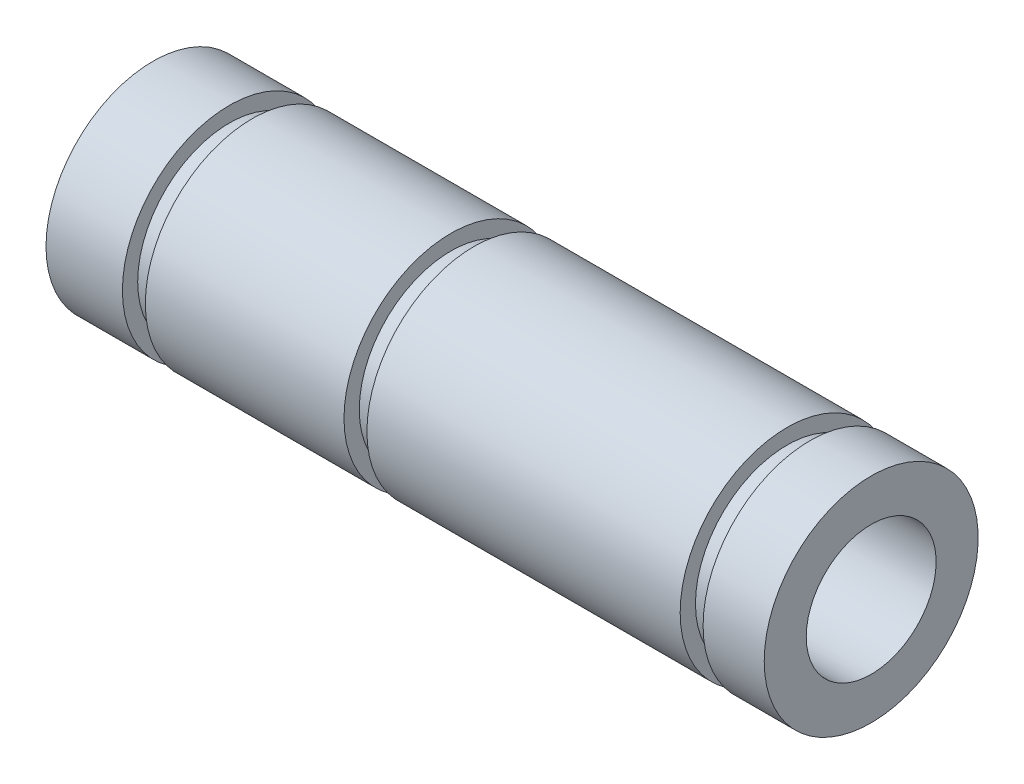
ISO-10303-21;
HEADER;
FILE_DESCRIPTION(('STEP AP214'),'2;1');
FILE_NAME('part.step','',(''),(''),'','','');
FILE_SCHEMA(('AUTOMOTIVE_DESIGN { 1 0 10303 214 1 1 1 1 }'));
ENDSEC;
DATA;
#1=APPLICATION_CONTEXT('core data for automotive mechanical design processes');
#2=APPLICATION_PROTOCOL_DEFINITION('international standard','automotive_design',2000,#1);
#3=PRODUCT_CONTEXT('',#1,'mechanical');
#4=PRODUCT('Part','Part','',(#3));
#5=PRODUCT_RELATED_PRODUCT_CATEGORY('part','',(#4));
#6=PRODUCT_DEFINITION_FORMATION('','',#4);
#7=PRODUCT_DEFINITION_CONTEXT('part definition',#1,'design');
#8=PRODUCT_DEFINITION('design','',#6,#7);
#9=PRODUCT_DEFINITION_SHAPE('','',#8);
#10=(LENGTH_UNIT() NAMED_UNIT(*) SI_UNIT(.MILLI.,.METRE.));
#11=(NAMED_UNIT(*) PLANE_ANGLE_UNIT() SI_UNIT($,.RADIAN.));
#12=(NAMED_UNIT(*) SI_UNIT($,.STERADIAN.) SOLID_ANGLE_UNIT());
#13=UNCERTAINTY_MEASURE_WITH_UNIT(LENGTH_MEASURE(1.E-05),#10,'distance_accuracy_value','');
#14=(GEOMETRIC_REPRESENTATION_CONTEXT(3) GLOBAL_UNCERTAINTY_ASSIGNED_CONTEXT((#13)) GLOBAL_UNIT_ASSIGNED_CONTEXT((#10,
#11,#12)) REPRESENTATION_CONTEXT('',''));
#15=CARTESIAN_POINT('',(0.,0.,0.));
#16=DIRECTION('',(0.,0.,1.));
#17=DIRECTION('',(1.,0.,0.));
#18=AXIS2_PLACEMENT_3D('',#15,#16,#17);
#19=CARTESIAN_POINT('',(0.,4.25,0.));
#20=DIRECTION('',(1.,0.,0.));
#21=DIRECTION('',(0.,0.,-1.));
#22=AXIS2_PLACEMENT_3D('',#19,#20,#21);
#23=PLANE('',#22);
#24=CARTESIAN_POINT('',(0.,0.,0.));
#25=DIRECTION('',(-1.,0.,0.));
#26=DIRECTION('',(0.,0.,1.));
#27=AXIS2_PLACEMENT_3D('',#24,#25,#26);
#28=CIRCLE('',#27,4.25);
#29=CARTESIAN_POINT('',(0.,0.,4.25));
#30=VERTEX_POINT('',#29);
#31=EDGE_CURVE('E84',#30,#30,#28,.T.);
#32=ORIENTED_EDGE('',*,*,#31,.F.);
#33=EDGE_LOOP('',(#32));
#34=FACE_BOUND('',#33,.T.);
#35=CARTESIAN_POINT('',(0.,0.,0.));
#36=DIRECTION('',(-1.,0.,0.));
#37=DIRECTION('',(0.,0.,1.));
#38=AXIS2_PLACEMENT_3D('',#35,#36,#37);
#39=CIRCLE('',#38,7.);
#40=CARTESIAN_POINT('',(0.,0.,7.));
#41=VERTEX_POINT('',#40);
#42=EDGE_CURVE('E10',#41,#41,#39,.T.);
#43=ORIENTED_EDGE('',*,*,#42,.T.);
#44=EDGE_LOOP('',(#43));
#45=FACE_BOUND('',#44,.T.);
#46=ADVANCED_FACE('F32',(#34,#45),#23,.F.);
#47=CARTESIAN_POINT('',(0.,0.,0.));
#48=DIRECTION('',(-1.,0.,0.));
#49=DIRECTION('',(0.,0.,1.));
#50=AXIS2_PLACEMENT_3D('',#47,#48,#49);
#51=CYLINDRICAL_SURFACE('',#50,7.);
#52=ORIENTED_EDGE('',*,*,#42,.F.);
#53=EDGE_LOOP('',(#52));
#54=FACE_BOUND('',#53,.T.);
#55=CARTESIAN_POINT('',(4.99999999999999,0.,0.));
#56=DIRECTION('',(-1.,0.,0.));
#57=DIRECTION('',(0.,0.,1.));
#58=AXIS2_PLACEMENT_3D('',#55,#56,#57);
#59=CIRCLE('',#58,7.);
#60=CARTESIAN_POINT('',(4.99999999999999,0.,7.));
#61=VERTEX_POINT('',#60);
#62=EDGE_CURVE('E38',#61,#61,#59,.T.);
#63=ORIENTED_EDGE('',*,*,#62,.T.);
#64=EDGE_LOOP('',(#63));
#65=FACE_BOUND('',#64,.T.);
#66=ADVANCED_FACE('F91',(#54,#65),#51,.T.);
#67=CARTESIAN_POINT('',(4.99999999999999,7.,0.));
#68=DIRECTION('',(-1.,0.,0.));
#69=DIRECTION('',(0.,0.,1.));
#70=AXIS2_PLACEMENT_3D('',#67,#68,#69);
#71=PLANE('',#70);
#72=ORIENTED_EDGE('',*,*,#62,.F.);
#73=EDGE_LOOP('',(#72));
#74=FACE_BOUND('',#73,.T.);
#75=CARTESIAN_POINT('',(4.99999999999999,0.,0.));
#76=DIRECTION('',(-1.,0.,0.));
#77=DIRECTION('',(0.,0.,1.));
#78=AXIS2_PLACEMENT_3D('',#75,#76,#77);
#79=CIRCLE('',#78,6.);
#80=CARTESIAN_POINT('',(4.99999999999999,0.,6.));
#81=VERTEX_POINT('',#80);
#82=EDGE_CURVE('E42',#81,#81,#79,.T.);
#83=ORIENTED_EDGE('',*,*,#82,.T.);
#84=EDGE_LOOP('',(#83));
#85=FACE_BOUND('',#84,.T.);
#86=ADVANCED_FACE('F95',(#74,#85),#71,.F.);
#87=CARTESIAN_POINT('',(0.,0.,0.));
#88=DIRECTION('',(-1.,0.,0.));
#89=DIRECTION('',(0.,0.,1.));
#90=AXIS2_PLACEMENT_3D('',#87,#88,#89);
#91=CYLINDRICAL_SURFACE('',#90,6.);
#92=ORIENTED_EDGE('',*,*,#82,.F.);
#93=EDGE_LOOP('',(#92));
#94=FACE_BOUND('',#93,.T.);
#95=CARTESIAN_POINT('',(6.49999999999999,0.,0.));
#96=DIRECTION('',(-1.,0.,0.));
#97=DIRECTION('',(0.,0.,1.));
#98=AXIS2_PLACEMENT_3D('',#95,#96,#97);
#99=CIRCLE('',#98,6.);
#100=CARTESIAN_POINT('',(6.49999999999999,0.,6.));
#101=VERTEX_POINT('',#100);
#102=EDGE_CURVE('E46',#101,#101,#99,.T.);
#103=ORIENTED_EDGE('',*,*,#102,.T.);
#104=EDGE_LOOP('',(#103));
#105=FACE_BOUND('',#104,.T.);
#106=ADVANCED_FACE('F100',(#94,#105),#91,.T.);
#107=CARTESIAN_POINT('',(6.49999999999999,7.,0.));
#108=DIRECTION('',(1.,0.,0.));
#109=DIRECTION('',(0.,0.,-1.));
#110=AXIS2_PLACEMENT_3D('',#107,#108,#109);
#111=PLANE('',#110);
#112=ORIENTED_EDGE('',*,*,#102,.F.);
#113=EDGE_LOOP('',(#112));
#114=FACE_BOUND('',#113,.T.);
#115=CARTESIAN_POINT('',(6.49999999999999,0.,0.));
#116=DIRECTION('',(-1.,0.,0.));
#117=DIRECTION('',(0.,0.,1.));
#118=AXIS2_PLACEMENT_3D('',#115,#116,#117);
#119=CIRCLE('',#118,7.);
#120=CARTESIAN_POINT('',(6.49999999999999,0.,7.));
#121=VERTEX_POINT('',#120);
#122=EDGE_CURVE('E51',#121,#121,#119,.T.);
#123=ORIENTED_EDGE('',*,*,#122,.T.);
#124=EDGE_LOOP('',(#123));
#125=FACE_BOUND('',#124,.T.);
#126=ADVANCED_FACE('F106',(#114,#125),#111,.F.);
#127=CARTESIAN_POINT('',(0.,0.,0.));
#128=DIRECTION('',(-1.,0.,0.));
#129=DIRECTION('',(0.,0.,1.));
#130=AXIS2_PLACEMENT_3D('',#127,#128,#129);
#131=CYLINDRICAL_SURFACE('',#130,7.);
#132=ORIENTED_EDGE('',*,*,#122,.F.);
#133=EDGE_LOOP('',(#132));
#134=FACE_BOUND('',#133,.T.);
#135=CARTESIAN_POINT('',(19.5,0.,0.));
#136=DIRECTION('',(-1.,0.,0.));
#137=DIRECTION('',(0.,0.,1.));
#138=AXIS2_PLACEMENT_3D('',#135,#136,#137);
#139=CIRCLE('',#138,7.);
#140=CARTESIAN_POINT('',(19.5,0.,7.));
#141=VERTEX_POINT('',#140);
#142=EDGE_CURVE('E54',#141,#141,#139,.T.);
#143=ORIENTED_EDGE('',*,*,#142,.T.);
#144=EDGE_LOOP('',(#143));
#145=FACE_BOUND('',#144,.T.);
#146=ADVANCED_FACE('F110',(#134,#145),#131,.T.);
#147=CARTESIAN_POINT('',(19.5,7.,0.));
#148=DIRECTION('',(-1.,0.,0.));
#149=DIRECTION('',(0.,0.,1.));
#150=AXIS2_PLACEMENT_3D('',#147,#148,#149);
#151=PLANE('',#150);
#152=ORIENTED_EDGE('',*,*,#142,.F.);
#153=EDGE_LOOP('',(#152));
#154=FACE_BOUND('',#153,.T.);
#155=CARTESIAN_POINT('',(19.5,0.,0.));
#156=DIRECTION('',(-1.,0.,0.));
#157=DIRECTION('',(0.,0.,1.));
#158=AXIS2_PLACEMENT_3D('',#155,#156,#157);
#159=CIRCLE('',#158,6.);
#160=CARTESIAN_POINT('',(19.5,0.,6.));
#161=VERTEX_POINT('',#160);
#162=EDGE_CURVE('E57',#161,#161,#159,.T.);
#163=ORIENTED_EDGE('',*,*,#162,.T.);
#164=EDGE_LOOP('',(#163));
#165=FACE_BOUND('',#164,.T.);
#166=ADVANCED_FACE('F114',(#154,#165),#151,.F.);
#167=CARTESIAN_POINT('',(0.,0.,0.));
#168=DIRECTION('',(-1.,0.,0.));
#169=DIRECTION('',(0.,0.,1.));
#170=AXIS2_PLACEMENT_3D('',#167,#168,#169);
#171=CYLINDRICAL_SURFACE('',#170,6.);
#172=ORIENTED_EDGE('',*,*,#162,.F.);
#173=EDGE_LOOP('',(#172));
#174=FACE_BOUND('',#173,.T.);
#175=CARTESIAN_POINT('',(21.,0.,0.));
#176=DIRECTION('',(-1.,0.,0.));
#177=DIRECTION('',(0.,0.,1.));
#178=AXIS2_PLACEMENT_3D('',#175,#176,#177);
#179=CIRCLE('',#178,6.);
#180=CARTESIAN_POINT('',(21.,0.,6.));
#181=VERTEX_POINT('',#180);
#182=EDGE_CURVE('E60',#181,#181,#179,.T.);
#183=ORIENTED_EDGE('',*,*,#182,.T.);
#184=EDGE_LOOP('',(#183));
#185=FACE_BOUND('',#184,.T.);
#186=ADVANCED_FACE('F118',(#174,#185),#171,.T.);
#187=CARTESIAN_POINT('',(21.,7.,0.));
#188=DIRECTION('',(1.,0.,0.));
#189=DIRECTION('',(0.,0.,-1.));
#190=AXIS2_PLACEMENT_3D('',#187,#188,#189);
#191=PLANE('',#190);
#192=ORIENTED_EDGE('',*,*,#182,.F.);
#193=EDGE_LOOP('',(#192));
#194=FACE_BOUND('',#193,.T.);
#195=CARTESIAN_POINT('',(21.,0.,0.));
#196=DIRECTION('',(-1.,0.,0.));
#197=DIRECTION('',(0.,0.,1.));
#198=AXIS2_PLACEMENT_3D('',#195,#196,#197);
#199=CIRCLE('',#198,7.);
#200=CARTESIAN_POINT('',(21.,0.,7.));
#201=VERTEX_POINT('',#200);
#202=EDGE_CURVE('E63',#201,#201,#199,.T.);
#203=ORIENTED_EDGE('',*,*,#202,.T.);
#204=EDGE_LOOP('',(#203));
#205=FACE_BOUND('',#204,.T.);
#206=ADVANCED_FACE('F122',(#194,#205),#191,.F.);
#207=CARTESIAN_POINT('',(0.,0.,0.));
#208=DIRECTION('',(-1.,0.,0.));
#209=DIRECTION('',(0.,0.,1.));
#210=AXIS2_PLACEMENT_3D('',#207,#208,#209);
#211=CYLINDRICAL_SURFACE('',#210,7.);
#212=ORIENTED_EDGE('',*,*,#202,.F.);
#213=EDGE_LOOP('',(#212));
#214=FACE_BOUND('',#213,.T.);
#215=CARTESIAN_POINT('',(41.5,0.,0.));
#216=DIRECTION('',(-1.,0.,0.));
#217=DIRECTION('',(0.,0.,1.));
#218=AXIS2_PLACEMENT_3D('',#215,#216,#217);
#219=CIRCLE('',#218,7.);
#220=CARTESIAN_POINT('',(41.5,0.,7.));
#221=VERTEX_POINT('',#220);
#222=EDGE_CURVE('E66',#221,#221,#219,.T.);
#223=ORIENTED_EDGE('',*,*,#222,.T.);
#224=EDGE_LOOP('',(#223));
#225=FACE_BOUND('',#224,.T.);
#226=ADVANCED_FACE('F126',(#214,#225),#211,.T.);
#227=CARTESIAN_POINT('',(41.5,7.,0.));
#228=DIRECTION('',(-1.,0.,0.));
#229=DIRECTION('',(0.,0.,1.));
#230=AXIS2_PLACEMENT_3D('',#227,#228,#229);
#231=PLANE('',#230);
#232=ORIENTED_EDGE('',*,*,#222,.F.);
#233=EDGE_LOOP('',(#232));
#234=FACE_BOUND('',#233,.T.);
#235=CARTESIAN_POINT('',(41.5,0.,0.));
#236=DIRECTION('',(-1.,0.,0.));
#237=DIRECTION('',(0.,0.,1.));
#238=AXIS2_PLACEMENT_3D('',#235,#236,#237);
#239=CIRCLE('',#238,6.);
#240=CARTESIAN_POINT('',(41.5,0.,6.));
#241=VERTEX_POINT('',#240);
#242=EDGE_CURVE('E69',#241,#241,#239,.T.);
#243=ORIENTED_EDGE('',*,*,#242,.T.);
#244=EDGE_LOOP('',(#243));
#245=FACE_BOUND('',#244,.T.);
#246=ADVANCED_FACE('F130',(#234,#245),#231,.F.);
#247=CARTESIAN_POINT('',(0.,0.,0.));
#248=DIRECTION('',(-1.,0.,0.));
#249=DIRECTION('',(0.,0.,1.));
#250=AXIS2_PLACEMENT_3D('',#247,#248,#249);
#251=CYLINDRICAL_SURFACE('',#250,6.);
#252=ORIENTED_EDGE('',*,*,#242,.F.);
#253=EDGE_LOOP('',(#252));
#254=FACE_BOUND('',#253,.T.);
#255=CARTESIAN_POINT('',(43.,0.,0.));
#256=DIRECTION('',(-1.,0.,0.));
#257=DIRECTION('',(0.,0.,1.));
#258=AXIS2_PLACEMENT_3D('',#255,#256,#257);
#259=CIRCLE('',#258,6.);
#260=CARTESIAN_POINT('',(43.,0.,6.));
#261=VERTEX_POINT('',#260);
#262=EDGE_CURVE('E72',#261,#261,#259,.T.);
#263=ORIENTED_EDGE('',*,*,#262,.T.);
#264=EDGE_LOOP('',(#263));
#265=FACE_BOUND('',#264,.T.);
#266=ADVANCED_FACE('F134',(#254,#265),#251,.T.);
#267=CARTESIAN_POINT('',(43.,7.,0.));
#268=DIRECTION('',(1.,0.,0.));
#269=DIRECTION('',(0.,0.,-1.));
#270=AXIS2_PLACEMENT_3D('',#267,#268,#269);
#271=PLANE('',#270);
#272=ORIENTED_EDGE('',*,*,#262,.F.);
#273=EDGE_LOOP('',(#272));
#274=FACE_BOUND('',#273,.T.);
#275=CARTESIAN_POINT('',(43.,0.,0.));
#276=DIRECTION('',(-1.,0.,0.));
#277=DIRECTION('',(0.,0.,1.));
#278=AXIS2_PLACEMENT_3D('',#275,#276,#277);
#279=CIRCLE('',#278,7.);
#280=CARTESIAN_POINT('',(43.,0.,7.));
#281=VERTEX_POINT('',#280);
#282=EDGE_CURVE('E75',#281,#281,#279,.T.);
#283=ORIENTED_EDGE('',*,*,#282,.T.);
#284=EDGE_LOOP('',(#283));
#285=FACE_BOUND('',#284,.T.);
#286=ADVANCED_FACE('F138',(#274,#285),#271,.F.);
#287=CARTESIAN_POINT('',(0.,0.,0.));
#288=DIRECTION('',(-1.,0.,0.));
#289=DIRECTION('',(0.,0.,1.));
#290=AXIS2_PLACEMENT_3D('',#287,#288,#289);
#291=CYLINDRICAL_SURFACE('',#290,7.);
#292=ORIENTED_EDGE('',*,*,#282,.F.);
#293=EDGE_LOOP('',(#292));
#294=FACE_BOUND('',#293,.T.);
#295=CARTESIAN_POINT('',(47.,0.,0.));
#296=DIRECTION('',(-1.,0.,0.));
#297=DIRECTION('',(0.,0.,1.));
#298=AXIS2_PLACEMENT_3D('',#295,#296,#297);
#299=CIRCLE('',#298,7.);
#300=CARTESIAN_POINT('',(47.,0.,7.));
#301=VERTEX_POINT('',#300);
#302=EDGE_CURVE('E78',#301,#301,#299,.T.);
#303=ORIENTED_EDGE('',*,*,#302,.T.);
#304=EDGE_LOOP('',(#303));
#305=FACE_BOUND('',#304,.T.);
#306=ADVANCED_FACE('F142',(#294,#305),#291,.T.);
#307=CARTESIAN_POINT('',(47.,4.25,0.));
#308=DIRECTION('',(-1.,0.,0.));
#309=DIRECTION('',(0.,0.,1.));
#310=AXIS2_PLACEMENT_3D('',#307,#308,#309);
#311=PLANE('',#310);
#312=ORIENTED_EDGE('',*,*,#302,.F.);
#313=EDGE_LOOP('',(#312));
#314=FACE_BOUND('',#313,.T.);
#315=CARTESIAN_POINT('',(47.,0.,0.));
#316=DIRECTION('',(-1.,0.,0.));
#317=DIRECTION('',(0.,0.,1.));
#318=AXIS2_PLACEMENT_3D('',#315,#316,#317);
#319=CIRCLE('',#318,4.25);
#320=CARTESIAN_POINT('',(47.,0.,4.25));
#321=VERTEX_POINT('',#320);
#322=EDGE_CURVE('E81',#321,#321,#319,.T.);
#323=ORIENTED_EDGE('',*,*,#322,.T.);
#324=EDGE_LOOP('',(#323));
#325=FACE_BOUND('',#324,.T.);
#326=ADVANCED_FACE('F146',(#314,#325),#311,.F.);
#327=CARTESIAN_POINT('',(0.,0.,0.));
#328=DIRECTION('',(-1.,0.,0.));
#329=DIRECTION('',(0.,0.,1.));
#330=AXIS2_PLACEMENT_3D('',#327,#328,#329);
#331=CYLINDRICAL_SURFACE('',#330,4.25);
#332=ORIENTED_EDGE('',*,*,#322,.F.);
#333=EDGE_LOOP('',(#332));
#334=FACE_BOUND('',#333,.T.);
#335=ORIENTED_EDGE('',*,*,#31,.T.);
#336=EDGE_LOOP('',(#335));
#337=FACE_BOUND('',#336,.T.);
#338=ADVANCED_FACE('F88',(#334,#337),#331,.F.);
#339=CLOSED_SHELL('',(#46,#66,#86,#106,#126,#146,#166,#186,#206,#226,#246,#266,#286,#306,#326,#338));
#340=MANIFOLD_SOLID_BREP('B2',#339);
#341=ADVANCED_BREP_SHAPE_REPRESENTATION('',(#18,#340),#14);
#342=SHAPE_DEFINITION_REPRESENTATION(#9,#341);
ENDSEC;
END-ISO-10303-21;
